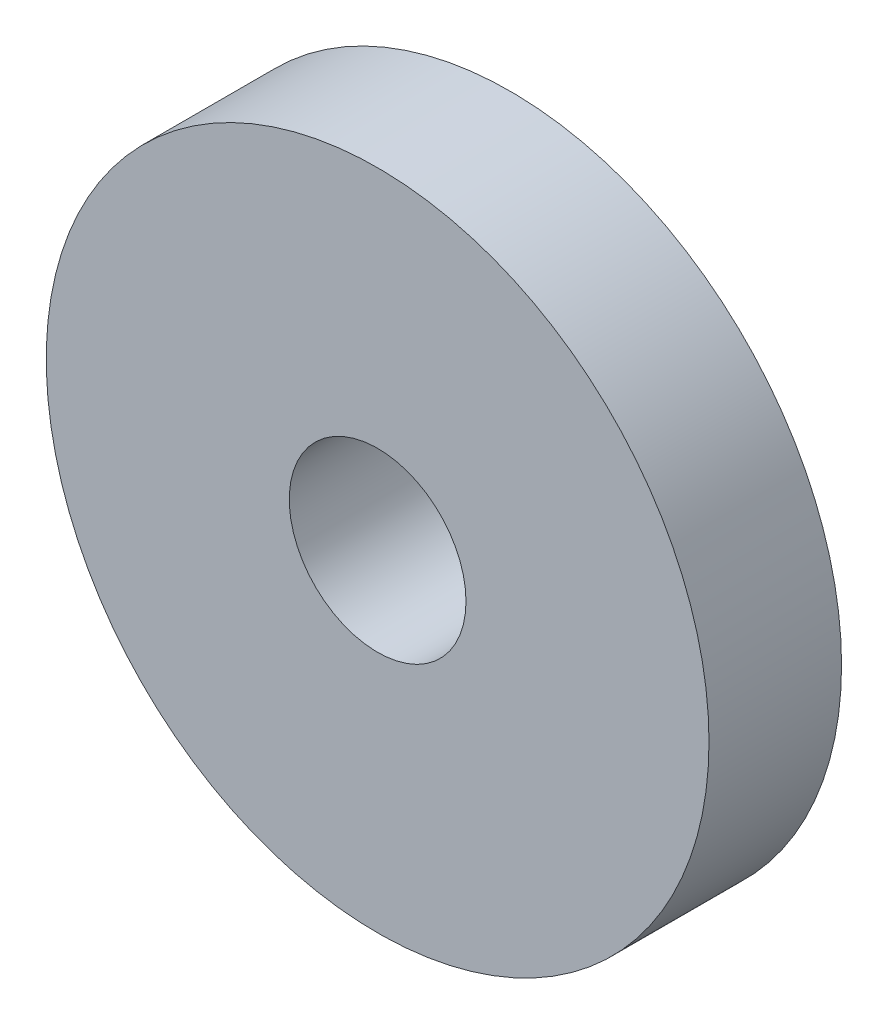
ISO-10303-21;
HEADER;
FILE_DESCRIPTION(('STEP AP214'),'2;1');
FILE_NAME('part.step','',(''),(''),'','','');
FILE_SCHEMA(('AUTOMOTIVE_DESIGN { 1 0 10303 214 1 1 1 1 }'));
ENDSEC;
DATA;
#1=APPLICATION_CONTEXT('core data for automotive mechanical design processes');
#2=APPLICATION_PROTOCOL_DEFINITION('international standard','automotive_design',2000,#1);
#3=PRODUCT_CONTEXT('',#1,'mechanical');
#4=PRODUCT('Part','Part','',(#3));
#5=PRODUCT_RELATED_PRODUCT_CATEGORY('part','',(#4));
#6=PRODUCT_DEFINITION_FORMATION('','',#4);
#7=PRODUCT_DEFINITION_CONTEXT('part definition',#1,'design');
#8=PRODUCT_DEFINITION('design','',#6,#7);
#9=PRODUCT_DEFINITION_SHAPE('','',#8);
#10=(LENGTH_UNIT() NAMED_UNIT(*) SI_UNIT(.MILLI.,.METRE.));
#11=(NAMED_UNIT(*) PLANE_ANGLE_UNIT() SI_UNIT($,.RADIAN.));
#12=(NAMED_UNIT(*) SI_UNIT($,.STERADIAN.) SOLID_ANGLE_UNIT());
#13=UNCERTAINTY_MEASURE_WITH_UNIT(LENGTH_MEASURE(1.E-05),#10,'distance_accuracy_value','');
#14=(GEOMETRIC_REPRESENTATION_CONTEXT(3) GLOBAL_UNCERTAINTY_ASSIGNED_CONTEXT((#13)) GLOBAL_UNIT_ASSIGNED_CONTEXT((#10,
#11,#12)) REPRESENTATION_CONTEXT('',''));
#15=CARTESIAN_POINT('',(0.,0.,0.));
#16=DIRECTION('',(0.,0.,1.));
#17=DIRECTION('',(1.,0.,0.));
#18=AXIS2_PLACEMENT_3D('',#15,#16,#17);
#19=CARTESIAN_POINT('',(0.,0.,20.));
#20=DIRECTION('',(0.,0.,1.));
#21=DIRECTION('',(1.,0.,0.));
#22=AXIS2_PLACEMENT_3D('',#19,#20,#21);
#23=CYLINDRICAL_SURFACE('',#22,4.);
#24=CARTESIAN_POINT('',(0.,0.,8.));
#25=DIRECTION('',(0.,0.,1.));
#26=DIRECTION('',(1.,0.,0.));
#27=AXIS2_PLACEMENT_3D('',#24,#25,#26);
#28=CIRCLE('',#27,4.);
#29=CARTESIAN_POINT('',(4.,0.,8.));
#30=VERTEX_POINT('',#29);
#31=EDGE_CURVE('E34',#30,#30,#28,.T.);
#32=ORIENTED_EDGE('',*,*,#31,.T.);
#33=EDGE_LOOP('',(#32));
#34=FACE_BOUND('',#33,.T.);
#35=CARTESIAN_POINT('',(0.,0.,0.));
#36=DIRECTION('',(0.,0.,1.));
#37=DIRECTION('',(1.,0.,0.));
#38=AXIS2_PLACEMENT_3D('',#35,#36,#37);
#39=CIRCLE('',#38,4.);
#40=CARTESIAN_POINT('',(4.,0.,0.));
#41=VERTEX_POINT('',#40);
#42=EDGE_CURVE('E8',#41,#41,#39,.T.);
#43=ORIENTED_EDGE('',*,*,#42,.F.);
#44=EDGE_LOOP('',(#43));
#45=FACE_BOUND('',#44,.T.);
#46=ADVANCED_FACE('F12',(#34,#45),#23,.F.);
#47=CARTESIAN_POINT('',(-8.,0.,0.));
#48=DIRECTION('',(0.,0.,-1.));
#49=DIRECTION('',(-1.,0.,0.));
#50=AXIS2_PLACEMENT_3D('',#47,#48,#49);
#51=PLANE('',#50);
#52=ORIENTED_EDGE('',*,*,#42,.T.);
#53=EDGE_LOOP('',(#52));
#54=FACE_BOUND('',#53,.T.);
#55=CARTESIAN_POINT('',(0.,0.,0.));
#56=DIRECTION('',(0.,0.,1.));
#57=DIRECTION('',(1.,0.,0.));
#58=AXIS2_PLACEMENT_3D('',#55,#56,#57);
#59=CIRCLE('',#58,8.);
#60=CARTESIAN_POINT('',(8.,0.,0.));
#61=VERTEX_POINT('',#60);
#62=EDGE_CURVE('E18',#61,#61,#59,.T.);
#63=ORIENTED_EDGE('',*,*,#62,.F.);
#64=EDGE_LOOP('',(#63));
#65=FACE_BOUND('',#64,.T.);
#66=ADVANCED_FACE('F53',(#54,#65),#51,.T.);
#67=CARTESIAN_POINT('',(0.,0.,20.));
#68=DIRECTION('',(0.,0.,1.));
#69=DIRECTION('',(1.,0.,0.));
#70=AXIS2_PLACEMENT_3D('',#67,#68,#69);
#71=CYLINDRICAL_SURFACE('',#70,8.);
#72=ORIENTED_EDGE('',*,*,#62,.T.);
#73=EDGE_LOOP('',(#72));
#74=FACE_BOUND('',#73,.T.);
#75=CARTESIAN_POINT('',(0.,0.,2.));
#76=DIRECTION('',(0.,0.,1.));
#77=DIRECTION('',(1.,0.,0.));
#78=AXIS2_PLACEMENT_3D('',#75,#76,#77);
#79=CIRCLE('',#78,8.);
#80=CARTESIAN_POINT('',(8.,0.,2.));
#81=VERTEX_POINT('',#80);
#82=EDGE_CURVE('E22',#81,#81,#79,.T.);
#83=ORIENTED_EDGE('',*,*,#82,.F.);
#84=EDGE_LOOP('',(#83));
#85=FACE_BOUND('',#84,.T.);
#86=ADVANCED_FACE('F57',(#74,#85),#71,.T.);
#87=CARTESIAN_POINT('',(-15.,0.,2.));
#88=DIRECTION('',(0.,0.,-1.));
#89=DIRECTION('',(-1.,0.,0.));
#90=AXIS2_PLACEMENT_3D('',#87,#88,#89);
#91=PLANE('',#90);
#92=ORIENTED_EDGE('',*,*,#82,.T.);
#93=EDGE_LOOP('',(#92));
#94=FACE_BOUND('',#93,.T.);
#95=CARTESIAN_POINT('',(0.,0.,2.));
#96=DIRECTION('',(0.,0.,1.));
#97=DIRECTION('',(1.,0.,0.));
#98=AXIS2_PLACEMENT_3D('',#95,#96,#97);
#99=CIRCLE('',#98,15.);
#100=CARTESIAN_POINT('',(15.,0.,2.));
#101=VERTEX_POINT('',#100);
#102=EDGE_CURVE('E26',#101,#101,#99,.T.);
#103=ORIENTED_EDGE('',*,*,#102,.F.);
#104=EDGE_LOOP('',(#103));
#105=FACE_BOUND('',#104,.T.);
#106=ADVANCED_FACE('F49',(#94,#105),#91,.T.);
#107=CARTESIAN_POINT('',(0.,0.,20.));
#108=DIRECTION('',(0.,0.,1.));
#109=DIRECTION('',(1.,0.,0.));
#110=AXIS2_PLACEMENT_3D('',#107,#108,#109);
#111=CYLINDRICAL_SURFACE('',#110,15.);
#112=ORIENTED_EDGE('',*,*,#102,.T.);
#113=EDGE_LOOP('',(#112));
#114=FACE_BOUND('',#113,.T.);
#115=CARTESIAN_POINT('',(0.,0.,8.));
#116=DIRECTION('',(0.,0.,1.));
#117=DIRECTION('',(1.,0.,0.));
#118=AXIS2_PLACEMENT_3D('',#115,#116,#117);
#119=CIRCLE('',#118,15.);
#120=CARTESIAN_POINT('',(15.,0.,8.));
#121=VERTEX_POINT('',#120);
#122=EDGE_CURVE('E31',#121,#121,#119,.T.);
#123=ORIENTED_EDGE('',*,*,#122,.F.);
#124=EDGE_LOOP('',(#123));
#125=FACE_BOUND('',#124,.T.);
#126=ADVANCED_FACE('F42',(#114,#125),#111,.T.);
#127=CARTESIAN_POINT('',(-4.,0.,8.));
#128=DIRECTION('',(0.,0.,1.));
#129=DIRECTION('',(1.,0.,0.));
#130=AXIS2_PLACEMENT_3D('',#127,#128,#129);
#131=PLANE('',#130);
#132=ORIENTED_EDGE('',*,*,#122,.T.);
#133=EDGE_LOOP('',(#132));
#134=FACE_BOUND('',#133,.T.);
#135=ORIENTED_EDGE('',*,*,#31,.F.);
#136=EDGE_LOOP('',(#135));
#137=FACE_BOUND('',#136,.T.);
#138=ADVANCED_FACE('F40',(#134,#137),#131,.T.);
#139=CLOSED_SHELL('',(#46,#66,#86,#106,#126,#138));
#140=MANIFOLD_SOLID_BREP('B1',#139);
#141=ADVANCED_BREP_SHAPE_REPRESENTATION('',(#18,#140),#14);
#142=SHAPE_DEFINITION_REPRESENTATION(#9,#141);
ENDSEC;
END-ISO-10303-21;
